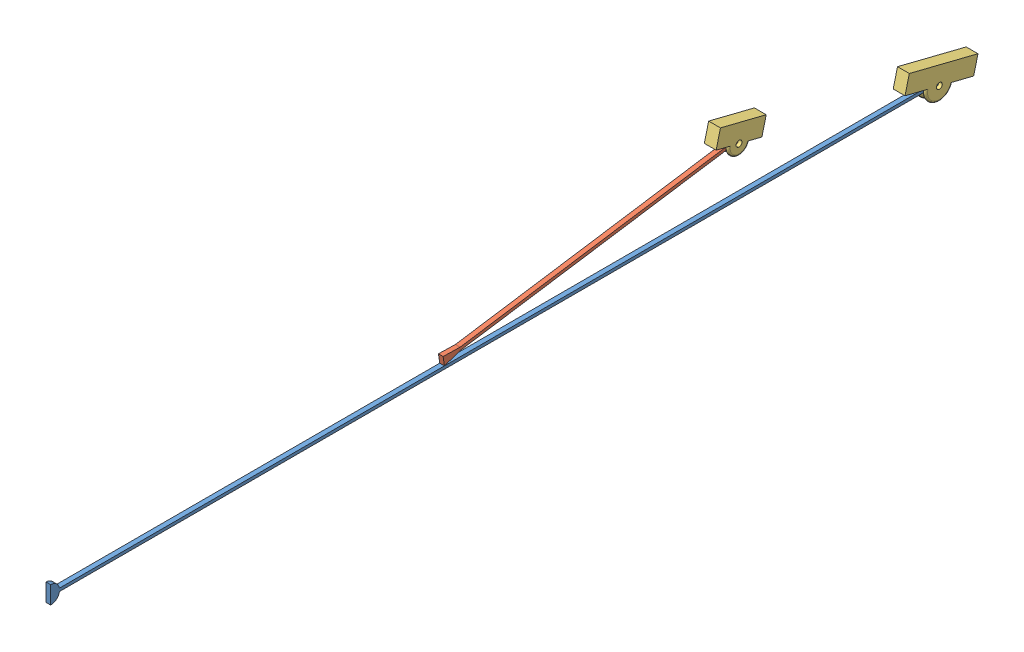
SolidWorks assembly Undercarriage.SLDASM, configuration Default (file format 10000). Lengths in mm.
Overall size (20 160.8 1565.49).
3 component instances, 3 part files, 5 mates.
Components (placement in the parent):
- Landing Leg-1: Landing Leg.SLDPRT [Default] at (526.5993 787.406 436.4424) size (8 30 1512.5)
- Support-1: Support.SLDPRT [Default] at (526.5993 872.4848 775.9443) x (1 0 0) z (0 -0.150328 0.988636) size (8 25 512.5)
- Undercarriage-1: Undercarriage.SLDPRT [Default] at (530.5993 787.406 436.4424) x (1 0 0) z (0 0.970006 -0.243082) size (20 450 53)
Mates (geometry in assembly coordinates):
- Concentric1: concentric anti-aligned: cylinder of Landing Leg-1 through (534.5993 787.406 436.4424) axis (-1 0 0) radius 12.5; circle of Undercarriage-1
- Coincident1: coincident anti-aligned: plane of Landing Leg-1 through (534.5993 787.406 1936.4424) normal (1 0 0); plane of Undercarriage-1 through (534.5993 787.406 436.4424) normal (-1 0 0)
- Concentric2: concentric aligned: circle of Support-1; circle of Undercarriage-1
- Coincident3: coincident anti-aligned: plane of Support-1 through (534.5993 872.4848 775.9443) normal (1 0 0); plane of Undercarriage-1 through (534.5993 872.4848 775.9443) normal (-1 0 0)
- Coincident4: coincident: plane of Landing Leg-1 through (534.5993 789.906 1921.6522) normal (0 1 0); line of Support-1 through (534.5993 789.906 1269.135) axis (-1 0 0)
